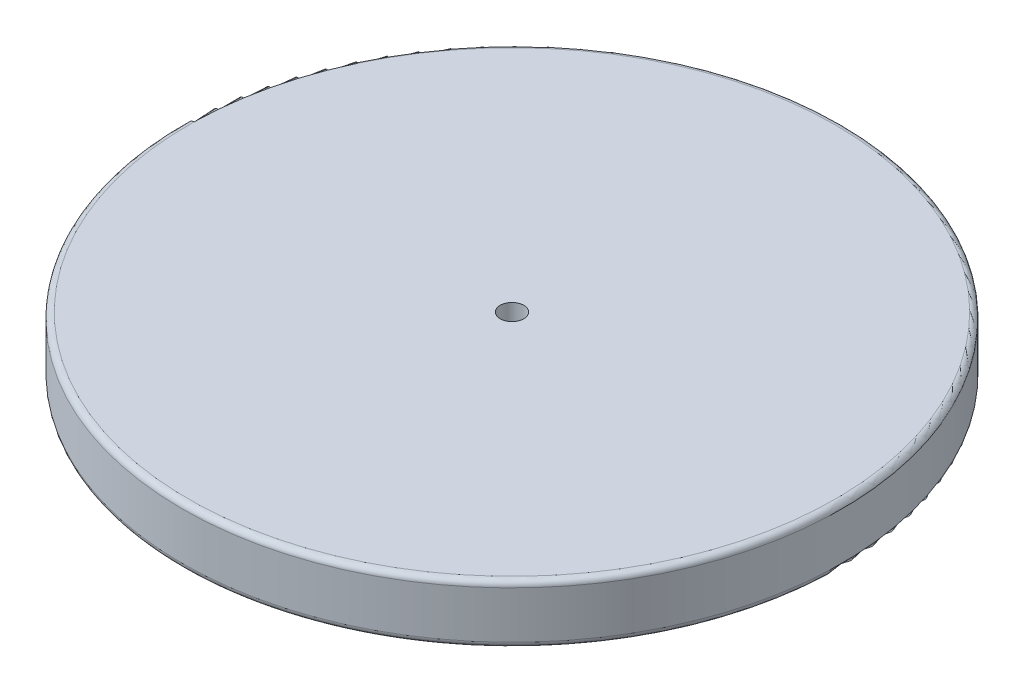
ISO-10303-21;
HEADER;
FILE_DESCRIPTION(('STEP AP214'),'2;1');
FILE_NAME('part.step','',(''),(''),'','','');
FILE_SCHEMA(('AUTOMOTIVE_DESIGN { 1 0 10303 214 1 1 1 1 }'));
ENDSEC;
DATA;
#1=APPLICATION_CONTEXT('core data for automotive mechanical design processes');
#2=APPLICATION_PROTOCOL_DEFINITION('international standard','automotive_design',2000,#1);
#3=PRODUCT_CONTEXT('',#1,'mechanical');
#4=PRODUCT('Part','Part','',(#3));
#5=PRODUCT_RELATED_PRODUCT_CATEGORY('part','',(#4));
#6=PRODUCT_DEFINITION_FORMATION('','',#4);
#7=PRODUCT_DEFINITION_CONTEXT('part definition',#1,'design');
#8=PRODUCT_DEFINITION('design','',#6,#7);
#9=PRODUCT_DEFINITION_SHAPE('','',#8);
#10=(LENGTH_UNIT() NAMED_UNIT(*) SI_UNIT(.MILLI.,.METRE.));
#11=(NAMED_UNIT(*) PLANE_ANGLE_UNIT() SI_UNIT($,.RADIAN.));
#12=(NAMED_UNIT(*) SI_UNIT($,.STERADIAN.) SOLID_ANGLE_UNIT());
#13=UNCERTAINTY_MEASURE_WITH_UNIT(LENGTH_MEASURE(1.E-05),#10,'distance_accuracy_value','');
#14=(GEOMETRIC_REPRESENTATION_CONTEXT(3) GLOBAL_UNCERTAINTY_ASSIGNED_CONTEXT((#13)) GLOBAL_UNIT_ASSIGNED_CONTEXT((#10,
#11,#12)) REPRESENTATION_CONTEXT('',''));
#15=CARTESIAN_POINT('',(0.,0.,0.));
#16=DIRECTION('',(0.,0.,1.));
#17=DIRECTION('',(1.,0.,0.));
#18=AXIS2_PLACEMENT_3D('',#15,#16,#17);
#19=CARTESIAN_POINT('',(0.,0.,0.));
#20=DIRECTION('',(0.,-1.,0.));
#21=DIRECTION('',(0.,0.,-1.));
#22=AXIS2_PLACEMENT_3D('',#19,#20,#21);
#23=CYLINDRICAL_SURFACE('',#22,5.00000000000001);
#24=CARTESIAN_POINT('',(0.,-12.5,0.));
#25=DIRECTION('',(0.,-1.,0.));
#26=DIRECTION('',(0.,0.,-1.));
#27=AXIS2_PLACEMENT_3D('',#24,#25,#26);
#28=CIRCLE('',#27,5.00000000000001);
#29=CARTESIAN_POINT('',(0.,-12.5,-5.00000000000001));
#30=VERTEX_POINT('',#29);
#31=EDGE_CURVE('E10',#30,#30,#28,.T.);
#32=ORIENTED_EDGE('',*,*,#31,.T.);
#33=EDGE_LOOP('',(#32));
#34=FACE_BOUND('',#33,.T.);
#35=CARTESIAN_POINT('',(0.,12.5,0.));
#36=DIRECTION('',(0.,-1.,0.));
#37=DIRECTION('',(0.,0.,-1.));
#38=AXIS2_PLACEMENT_3D('',#35,#36,#37);
#39=CIRCLE('',#38,5.00000000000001);
#40=CARTESIAN_POINT('',(0.,12.5,-5.00000000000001));
#41=VERTEX_POINT('',#40);
#42=EDGE_CURVE('E63',#41,#41,#39,.T.);
#43=ORIENTED_EDGE('',*,*,#42,.F.);
#44=EDGE_LOOP('',(#43));
#45=FACE_BOUND('',#44,.T.);
#46=ADVANCED_FACE('F41',(#34,#45),#23,.F.);
#47=CARTESIAN_POINT('',(5.00000000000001,-12.5,0.));
#48=DIRECTION('',(0.,-1.,0.));
#49=DIRECTION('',(0.,0.,-1.));
#50=AXIS2_PLACEMENT_3D('',#47,#48,#49);
#51=PLANE('',#50);
#52=CARTESIAN_POINT('',(0.,-12.5,0.));
#53=DIRECTION('',(0.,-1.,0.));
#54=DIRECTION('',(0.,0.,-1.));
#55=AXIS2_PLACEMENT_3D('',#52,#53,#54);
#56=CIRCLE('',#55,137.5);
#57=CARTESIAN_POINT('',(0.,-12.5,-137.5));
#58=VERTEX_POINT('',#57);
#59=EDGE_CURVE('E47',#58,#58,#56,.T.);
#60=ORIENTED_EDGE('',*,*,#59,.T.);
#61=EDGE_LOOP('',(#60));
#62=FACE_BOUND('',#61,.T.);
#63=ORIENTED_EDGE('',*,*,#31,.F.);
#64=EDGE_LOOP('',(#63));
#65=FACE_BOUND('',#64,.T.);
#66=ADVANCED_FACE('F71',(#62,#65),#51,.T.);
#67=CARTESIAN_POINT('',(0.,-10.,0.));
#68=DIRECTION('',(0.,-1.,0.));
#69=DIRECTION('',(0.,0.,-1.));
#70=AXIS2_PLACEMENT_3D('',#67,#68,#69);
#71=TOROIDAL_SURFACE('',#70,137.5,2.49999999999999);
#72=CARTESIAN_POINT('',(0.,-10.,0.));
#73=DIRECTION('',(0.,-1.,0.));
#74=DIRECTION('',(0.,0.,-1.));
#75=AXIS2_PLACEMENT_3D('',#72,#73,#74);
#76=CIRCLE('',#75,140.);
#77=CARTESIAN_POINT('',(0.,-10.,-140.));
#78=VERTEX_POINT('',#77);
#79=EDGE_CURVE('E51',#78,#78,#76,.T.);
#80=ORIENTED_EDGE('',*,*,#79,.T.);
#81=EDGE_LOOP('',(#80));
#82=FACE_BOUND('',#81,.T.);
#83=ORIENTED_EDGE('',*,*,#59,.F.);
#84=EDGE_LOOP('',(#83));
#85=FACE_BOUND('',#84,.T.);
#86=ADVANCED_FACE('F75',(#82,#85),#71,.T.);
#87=CARTESIAN_POINT('',(0.,0.,0.));
#88=DIRECTION('',(0.,-1.,0.));
#89=DIRECTION('',(0.,0.,-1.));
#90=AXIS2_PLACEMENT_3D('',#87,#88,#89);
#91=CYLINDRICAL_SURFACE('',#90,140.);
#92=CARTESIAN_POINT('',(0.,10.,0.));
#93=DIRECTION('',(0.,-1.,0.));
#94=DIRECTION('',(0.,0.,-1.));
#95=AXIS2_PLACEMENT_3D('',#92,#93,#94);
#96=CIRCLE('',#95,140.);
#97=CARTESIAN_POINT('',(0.,10.,-140.));
#98=VERTEX_POINT('',#97);
#99=EDGE_CURVE('E55',#98,#98,#96,.T.);
#100=ORIENTED_EDGE('',*,*,#99,.T.);
#101=EDGE_LOOP('',(#100));
#102=FACE_BOUND('',#101,.T.);
#103=ORIENTED_EDGE('',*,*,#79,.F.);
#104=EDGE_LOOP('',(#103));
#105=FACE_BOUND('',#104,.T.);
#106=ADVANCED_FACE('F79',(#102,#105),#91,.T.);
#107=CARTESIAN_POINT('',(0.,10.,0.));
#108=DIRECTION('',(0.,-1.,0.));
#109=DIRECTION('',(0.,0.,-1.));
#110=AXIS2_PLACEMENT_3D('',#107,#108,#109);
#111=TOROIDAL_SURFACE('',#110,137.5,2.49999999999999);
#112=CARTESIAN_POINT('',(0.,12.5,0.));
#113=DIRECTION('',(0.,-1.,0.));
#114=DIRECTION('',(0.,0.,-1.));
#115=AXIS2_PLACEMENT_3D('',#112,#113,#114);
#116=CIRCLE('',#115,137.5);
#117=CARTESIAN_POINT('',(0.,12.5,-137.5));
#118=VERTEX_POINT('',#117);
#119=EDGE_CURVE('E60',#118,#118,#116,.T.);
#120=ORIENTED_EDGE('',*,*,#119,.T.);
#121=EDGE_LOOP('',(#120));
#122=FACE_BOUND('',#121,.T.);
#123=ORIENTED_EDGE('',*,*,#99,.F.);
#124=EDGE_LOOP('',(#123));
#125=FACE_BOUND('',#124,.T.);
#126=ADVANCED_FACE('F86',(#122,#125),#111,.T.);
#127=CARTESIAN_POINT('',(5.00000000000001,12.5,0.));
#128=DIRECTION('',(0.,1.,0.));
#129=DIRECTION('',(0.,0.,1.));
#130=AXIS2_PLACEMENT_3D('',#127,#128,#129);
#131=PLANE('',#130);
#132=ORIENTED_EDGE('',*,*,#42,.T.);
#133=EDGE_LOOP('',(#132));
#134=FACE_BOUND('',#133,.T.);
#135=ORIENTED_EDGE('',*,*,#119,.F.);
#136=EDGE_LOOP('',(#135));
#137=FACE_BOUND('',#136,.T.);
#138=ADVANCED_FACE('F67',(#134,#137),#131,.T.);
#139=CLOSED_SHELL('',(#46,#66,#86,#106,#126,#138));
#140=MANIFOLD_SOLID_BREP('B2',#139);
#141=ADVANCED_BREP_SHAPE_REPRESENTATION('',(#18,#140),#14);
#142=SHAPE_DEFINITION_REPRESENTATION(#9,#141);
ENDSEC;
END-ISO-10303-21;
